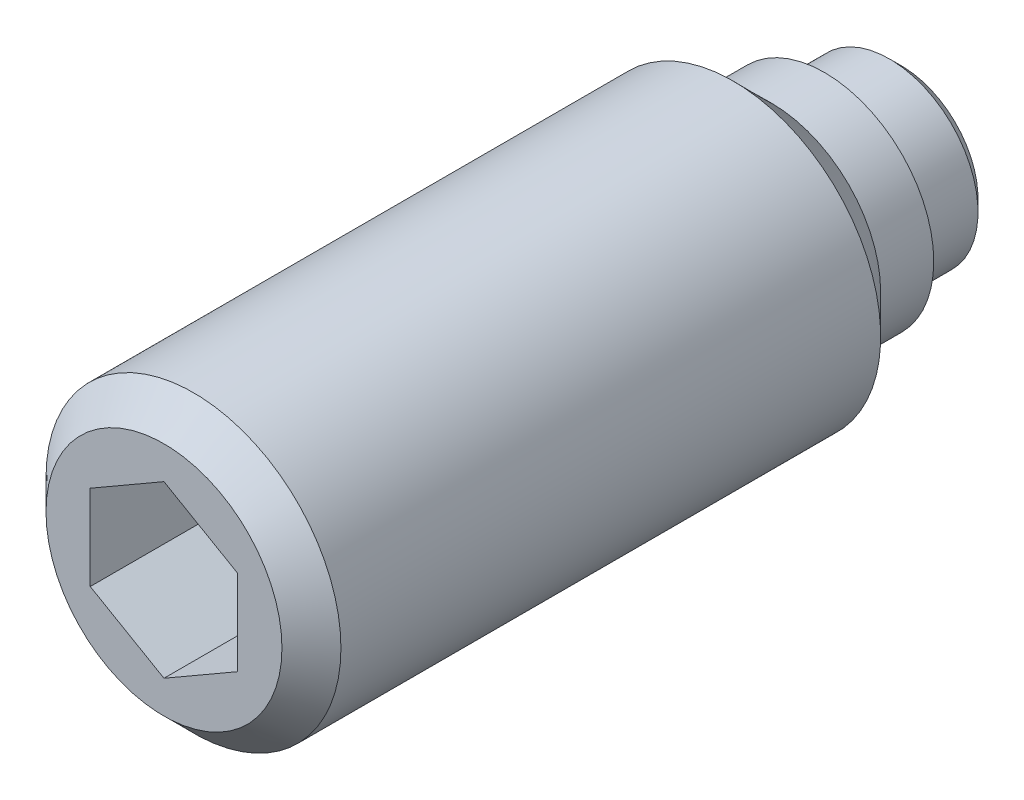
ISO-10303-21;
HEADER;
FILE_DESCRIPTION(('STEP AP214'),'2;1');
FILE_NAME('part.step','',(''),(''),'','','');
FILE_SCHEMA(('AUTOMOTIVE_DESIGN { 1 0 10303 214 1 1 1 1 }'));
ENDSEC;
DATA;
#1=APPLICATION_CONTEXT('core data for automotive mechanical design processes');
#2=APPLICATION_PROTOCOL_DEFINITION('international standard','automotive_design',2000,#1);
#3=PRODUCT_CONTEXT('',#1,'mechanical');
#4=PRODUCT('Part','Part','',(#3));
#5=PRODUCT_RELATED_PRODUCT_CATEGORY('part','',(#4));
#6=PRODUCT_DEFINITION_FORMATION('','',#4);
#7=PRODUCT_DEFINITION_CONTEXT('part definition',#1,'design');
#8=PRODUCT_DEFINITION('design','',#6,#7);
#9=PRODUCT_DEFINITION_SHAPE('','',#8);
#10=(LENGTH_UNIT() NAMED_UNIT(*) SI_UNIT(.MILLI.,.METRE.));
#11=(NAMED_UNIT(*) PLANE_ANGLE_UNIT() SI_UNIT($,.RADIAN.));
#12=(NAMED_UNIT(*) SI_UNIT($,.STERADIAN.) SOLID_ANGLE_UNIT());
#13=UNCERTAINTY_MEASURE_WITH_UNIT(LENGTH_MEASURE(1.E-05),#10,'distance_accuracy_value','');
#14=(GEOMETRIC_REPRESENTATION_CONTEXT(3) GLOBAL_UNCERTAINTY_ASSIGNED_CONTEXT((#13)) GLOBAL_UNIT_ASSIGNED_CONTEXT((#10,
#11,#12)) REPRESENTATION_CONTEXT('',''));
#15=CARTESIAN_POINT('',(0.,0.,0.));
#16=DIRECTION('',(0.,0.,1.));
#17=DIRECTION('',(1.,0.,0.));
#18=AXIS2_PLACEMENT_3D('',#15,#16,#17);
#19=CARTESIAN_POINT('',(0.,1.85,1.3));
#20=DIRECTION('',(0.,0.,1.));
#21=DIRECTION('',(1.,0.,0.));
#22=AXIS2_PLACEMENT_3D('',#19,#20,#21);
#23=PLANE('',#22);
#24=CARTESIAN_POINT('',(0.,0.,1.3));
#25=DIRECTION('',(0.,0.,-1.));
#26=DIRECTION('',(-1.,0.,0.));
#27=AXIS2_PLACEMENT_3D('',#24,#25,#26);
#28=CIRCLE('',#27,1.5);
#29=CARTESIAN_POINT('',(-1.5,0.,1.3));
#30=VERTEX_POINT('',#29);
#31=EDGE_CURVE('E130',#30,#30,#28,.T.);
#32=ORIENTED_EDGE('',*,*,#31,.F.);
#33=EDGE_LOOP('',(#32));
#34=FACE_BOUND('',#33,.T.);
#35=CARTESIAN_POINT('',(0.,0.,1.3));
#36=DIRECTION('',(0.,0.,-1.));
#37=DIRECTION('',(-1.,0.,0.));
#38=AXIS2_PLACEMENT_3D('',#35,#36,#37);
#39=CIRCLE('',#38,1.85);
#40=CARTESIAN_POINT('',(-1.85,0.,1.3));
#41=VERTEX_POINT('',#40);
#42=EDGE_CURVE('E133',#41,#41,#39,.T.);
#43=ORIENTED_EDGE('',*,*,#42,.T.);
#44=EDGE_LOOP('',(#43));
#45=FACE_BOUND('',#44,.T.);
#46=ADVANCED_FACE('F14',(#34,#45),#23,.F.);
#47=CARTESIAN_POINT('',(0.,0.,1.3));
#48=DIRECTION('',(0.,0.,-1.));
#49=DIRECTION('',(-1.,0.,0.));
#50=AXIS2_PLACEMENT_3D('',#47,#48,#49);
#51=CYLINDRICAL_SURFACE('',#50,2.5);
#52=CARTESIAN_POINT('',(0.,0.,12.));
#53=DIRECTION('',(0.,0.,1.));
#54=DIRECTION('',(1.,0.,0.));
#55=AXIS2_PLACEMENT_3D('',#52,#53,#54);
#56=CIRCLE('',#55,2.5);
#57=CARTESIAN_POINT('',(2.5,0.,12.));
#58=VERTEX_POINT('',#57);
#59=EDGE_CURVE('E9',#58,#58,#56,.F.);
#60=ORIENTED_EDGE('',*,*,#59,.T.);
#61=EDGE_LOOP('',(#60));
#62=FACE_BOUND('',#61,.T.);
#63=CARTESIAN_POINT('',(0.,0.,2.85));
#64=DIRECTION('',(0.,0.,-1.));
#65=DIRECTION('',(-1.,0.,0.));
#66=AXIS2_PLACEMENT_3D('',#63,#64,#65);
#67=CIRCLE('',#66,2.5);
#68=CARTESIAN_POINT('',(-2.5,0.,2.85));
#69=VERTEX_POINT('',#68);
#70=EDGE_CURVE('E139',#69,#69,#67,.T.);
#71=ORIENTED_EDGE('',*,*,#70,.F.);
#72=EDGE_LOOP('',(#71));
#73=FACE_BOUND('',#72,.T.);
#74=ADVANCED_FACE('F157',(#62,#73),#51,.T.);
#75=CARTESIAN_POINT('',(0.,0.,2.85));
#76=DIRECTION('',(0.,0.,1.));
#77=DIRECTION('',(1.,0.,0.));
#78=AXIS2_PLACEMENT_3D('',#75,#76,#77);
#79=CONICAL_SURFACE('',#78,2.5,0.785398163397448);
#80=CARTESIAN_POINT('',(0.,0.,2.2));
#81=DIRECTION('',(0.,0.,-1.));
#82=DIRECTION('',(-1.,0.,0.));
#83=AXIS2_PLACEMENT_3D('',#80,#81,#82);
#84=CIRCLE('',#83,1.85);
#85=CARTESIAN_POINT('',(-1.85,0.,2.2));
#86=VERTEX_POINT('',#85);
#87=EDGE_CURVE('E136',#86,#86,#84,.T.);
#88=ORIENTED_EDGE('',*,*,#87,.F.);
#89=EDGE_LOOP('',(#88));
#90=FACE_BOUND('',#89,.T.);
#91=ORIENTED_EDGE('',*,*,#70,.T.);
#92=EDGE_LOOP('',(#91));
#93=FACE_BOUND('',#92,.T.);
#94=ADVANCED_FACE('F164',(#90,#93),#79,.T.);
#95=CARTESIAN_POINT('',(0.,0.,1.3));
#96=DIRECTION('',(0.,0.,-1.));
#97=DIRECTION('',(-1.,0.,0.));
#98=AXIS2_PLACEMENT_3D('',#95,#96,#97);
#99=CYLINDRICAL_SURFACE('',#98,1.85);
#100=ORIENTED_EDGE('',*,*,#42,.F.);
#101=EDGE_LOOP('',(#100));
#102=FACE_BOUND('',#101,.T.);
#103=ORIENTED_EDGE('',*,*,#87,.T.);
#104=EDGE_LOOP('',(#103));
#105=FACE_BOUND('',#104,.T.);
#106=ADVANCED_FACE('F172',(#102,#105),#99,.T.);
#107=CARTESIAN_POINT('',(0.,0.,-0.5));
#108=DIRECTION('',(0.,0.,-1.));
#109=DIRECTION('',(-1.,0.,0.));
#110=AXIS2_PLACEMENT_3D('',#107,#108,#109);
#111=CYLINDRICAL_SURFACE('',#110,1.5);
#112=CARTESIAN_POINT('',(0.,0.,0.2));
#113=DIRECTION('',(0.,0.,-1.));
#114=DIRECTION('',(-1.,0.,0.));
#115=AXIS2_PLACEMENT_3D('',#112,#113,#114);
#116=CIRCLE('',#115,1.5);
#117=CARTESIAN_POINT('',(-1.5,0.,0.2));
#118=VERTEX_POINT('',#117);
#119=EDGE_CURVE('E127',#118,#118,#116,.T.);
#120=ORIENTED_EDGE('',*,*,#119,.F.);
#121=EDGE_LOOP('',(#120));
#122=FACE_BOUND('',#121,.T.);
#123=ORIENTED_EDGE('',*,*,#31,.T.);
#124=EDGE_LOOP('',(#123));
#125=FACE_BOUND('',#124,.T.);
#126=ADVANCED_FACE('F170',(#122,#125),#111,.T.);
#127=CARTESIAN_POINT('',(0.,0.,0.2));
#128=DIRECTION('',(0.,0.,1.));
#129=DIRECTION('',(1.,0.,0.));
#130=AXIS2_PLACEMENT_3D('',#127,#128,#129);
#131=CONICAL_SURFACE('',#130,1.5,0.785398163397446);
#132=CARTESIAN_POINT('',(0.,0.,0.));
#133=DIRECTION('',(0.,0.,-1.));
#134=DIRECTION('',(-1.,0.,0.));
#135=AXIS2_PLACEMENT_3D('',#132,#133,#134);
#136=CIRCLE('',#135,1.3);
#137=CARTESIAN_POINT('',(-1.3,0.,0.));
#138=VERTEX_POINT('',#137);
#139=EDGE_CURVE('E124',#138,#138,#136,.T.);
#140=ORIENTED_EDGE('',*,*,#139,.F.);
#141=EDGE_LOOP('',(#140));
#142=FACE_BOUND('',#141,.T.);
#143=ORIENTED_EDGE('',*,*,#119,.T.);
#144=EDGE_LOOP('',(#143));
#145=FACE_BOUND('',#144,.T.);
#146=ADVANCED_FACE('F204',(#142,#145),#131,.T.);
#147=CARTESIAN_POINT('',(0.,1.3,0.));
#148=DIRECTION('',(0.,0.,1.));
#149=DIRECTION('',(1.,0.,0.));
#150=AXIS2_PLACEMENT_3D('',#147,#148,#149);
#151=PLANE('',#150);
#152=CARTESIAN_POINT('',(0.,0.,0.));
#153=DIRECTION('',(0.,0.,-1.));
#154=DIRECTION('',(-1.,0.,0.));
#155=AXIS2_PLACEMENT_3D('',#152,#153,#154);
#156=CIRCLE('',#155,0.5);
#157=CARTESIAN_POINT('',(-0.5,0.,0.));
#158=VERTEX_POINT('',#157);
#159=EDGE_CURVE('E114',#158,#158,#156,.T.);
#160=ORIENTED_EDGE('',*,*,#159,.F.);
#161=EDGE_LOOP('',(#160));
#162=FACE_BOUND('',#161,.T.);
#163=ORIENTED_EDGE('',*,*,#139,.T.);
#164=EDGE_LOOP('',(#163));
#165=FACE_BOUND('',#164,.T.);
#166=ADVANCED_FACE('F212',(#162,#165),#151,.F.);
#167=CARTESIAN_POINT('',(0.,0.,0.));
#168=DIRECTION('',(0.,0.,1.));
#169=DIRECTION('',(1.,0.,0.));
#170=AXIS2_PLACEMENT_3D('',#167,#168,#169);
#171=CONICAL_SURFACE('',#170,0.5,0.785398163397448);
#172=CARTESIAN_POINT('',(0.,0.,-0.5));
#173=VERTEX_POINT('',#172);
#174=VERTEX_LOOP('',#173);
#175=FACE_BOUND('',#174,.T.);
#176=ORIENTED_EDGE('',*,*,#159,.T.);
#177=EDGE_LOOP('',(#176));
#178=FACE_BOUND('',#177,.T.);
#179=ADVANCED_FACE('F220',(#175,#178),#171,.T.);
#180=CARTESIAN_POINT('',(0.,0.,12.5));
#181=DIRECTION('',(0.,0.,1.));
#182=DIRECTION('',(1.,0.,0.));
#183=AXIS2_PLACEMENT_3D('',#180,#181,#182);
#184=PLANE('',#183);
#185=CARTESIAN_POINT('',(0.,0.,12.5));
#186=DIRECTION('',(0.,0.,1.));
#187=DIRECTION('',(1.,0.,0.));
#188=AXIS2_PLACEMENT_3D('',#185,#186,#187);
#189=CIRCLE('',#188,2.);
#190=CARTESIAN_POINT('',(2.,0.,12.5));
#191=VERTEX_POINT('',#190);
#192=EDGE_CURVE('E22',#191,#191,#189,.T.);
#193=ORIENTED_EDGE('',*,*,#192,.T.);
#194=EDGE_LOOP('',(#193));
#195=FACE_BOUND('',#194,.T.);
#196=DIRECTION('',(-0.866025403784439,0.5,0.));
#197=VECTOR('',#196,1.);
#198=CARTESIAN_POINT('',(1.25,0.721687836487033,12.5));
#199=LINE('',#198,#197);
#200=CARTESIAN_POINT('',(1.25,0.721687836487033,12.5));
#201=VERTEX_POINT('',#200);
#202=CARTESIAN_POINT('',(0.,1.44337567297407,12.5));
#203=VERTEX_POINT('',#202);
#204=EDGE_CURVE('E29',#201,#203,#199,.T.);
#205=ORIENTED_EDGE('',*,*,#204,.F.);
#206=DIRECTION('',(0.,1.,0.));
#207=VECTOR('',#206,1.);
#208=CARTESIAN_POINT('',(1.25,-0.721687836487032,12.5));
#209=LINE('',#208,#207);
#210=CARTESIAN_POINT('',(1.25,-0.721687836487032,12.5));
#211=VERTEX_POINT('',#210);
#212=EDGE_CURVE('E88',#211,#201,#209,.T.);
#213=ORIENTED_EDGE('',*,*,#212,.F.);
#214=DIRECTION('',(0.866025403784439,0.5,0.));
#215=VECTOR('',#214,1.);
#216=CARTESIAN_POINT('',(0.,-1.44337567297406,12.5));
#217=LINE('',#216,#215);
#218=CARTESIAN_POINT('',(0.,-1.44337567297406,12.5));
#219=VERTEX_POINT('',#218);
#220=EDGE_CURVE('E91',#219,#211,#217,.T.);
#221=ORIENTED_EDGE('',*,*,#220,.F.);
#222=DIRECTION('',(0.866025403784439,-0.5,0.));
#223=VECTOR('',#222,1.);
#224=CARTESIAN_POINT('',(-1.25,-0.721687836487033,12.5));
#225=LINE('',#224,#223);
#226=CARTESIAN_POINT('',(-1.25,-0.721687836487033,12.5));
#227=VERTEX_POINT('',#226);
#228=EDGE_CURVE('E107',#227,#219,#225,.T.);
#229=ORIENTED_EDGE('',*,*,#228,.F.);
#230=DIRECTION('',(0.,-1.,0.));
#231=VECTOR('',#230,1.);
#232=CARTESIAN_POINT('',(-1.25,0.721687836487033,12.5));
#233=LINE('',#232,#231);
#234=CARTESIAN_POINT('',(-1.25,0.721687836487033,12.5));
#235=VERTEX_POINT('',#234);
#236=EDGE_CURVE('E104',#235,#227,#233,.T.);
#237=ORIENTED_EDGE('',*,*,#236,.F.);
#238=DIRECTION('',(-0.866025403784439,-0.5,0.));
#239=VECTOR('',#238,1.);
#240=CARTESIAN_POINT('',(0.,1.44337567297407,12.5));
#241=LINE('',#240,#239);
#242=EDGE_CURVE('E102',#203,#235,#241,.T.);
#243=ORIENTED_EDGE('',*,*,#242,.F.);
#244=EDGE_LOOP('',(#205,#213,#221,#229,#237,#243));
#245=FACE_BOUND('',#244,.T.);
#246=ADVANCED_FACE('F144',(#195,#245),#184,.T.);
#247=CARTESIAN_POINT('',(1.25,0.721687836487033,9.5));
#248=DIRECTION('',(0.5,0.866025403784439,0.));
#249=DIRECTION('',(-0.866025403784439,0.5,0.));
#250=AXIS2_PLACEMENT_3D('',#247,#248,#249);
#251=PLANE('',#250);
#252=ORIENTED_EDGE('',*,*,#204,.T.);
#253=DIRECTION('',(0.,0.,1.));
#254=VECTOR('',#253,1.);
#255=CARTESIAN_POINT('',(0.,1.44337567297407,9.5));
#256=LINE('',#255,#254);
#257=CARTESIAN_POINT('',(0.,1.44337567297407,9.5));
#258=VERTEX_POINT('',#257);
#259=EDGE_CURVE('E65',#258,#203,#256,.T.);
#260=ORIENTED_EDGE('',*,*,#259,.F.);
#261=DIRECTION('',(-0.866025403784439,0.5,0.));
#262=VECTOR('',#261,1.);
#263=CARTESIAN_POINT('',(1.25,0.721687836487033,9.5));
#264=LINE('',#263,#262);
#265=CARTESIAN_POINT('',(1.25,0.721687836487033,9.5));
#266=VERTEX_POINT('',#265);
#267=EDGE_CURVE('E69',#266,#258,#264,.T.);
#268=ORIENTED_EDGE('',*,*,#267,.F.);
#269=DIRECTION('',(0.,0.,1.));
#270=VECTOR('',#269,1.);
#271=CARTESIAN_POINT('',(1.25,0.721687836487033,9.5));
#272=LINE('',#271,#270);
#273=EDGE_CURVE('E112',#266,#201,#272,.T.);
#274=ORIENTED_EDGE('',*,*,#273,.T.);
#275=EDGE_LOOP('',(#252,#260,#268,#274));
#276=FACE_BOUND('',#275,.T.);
#277=ADVANCED_FACE('F67',(#276),#251,.F.);
#278=CARTESIAN_POINT('',(1.25,-0.721687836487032,9.5));
#279=DIRECTION('',(1.,0.,0.));
#280=DIRECTION('',(0.,0.,-1.));
#281=AXIS2_PLACEMENT_3D('',#278,#279,#280);
#282=PLANE('',#281);
#283=ORIENTED_EDGE('',*,*,#212,.T.);
#284=ORIENTED_EDGE('',*,*,#273,.F.);
#285=DIRECTION('',(0.,1.,0.));
#286=VECTOR('',#285,1.);
#287=CARTESIAN_POINT('',(1.25,-0.721687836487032,9.5));
#288=LINE('',#287,#286);
#289=CARTESIAN_POINT('',(1.25,-0.721687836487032,9.5));
#290=VERTEX_POINT('',#289);
#291=EDGE_CURVE('E75',#290,#266,#288,.T.);
#292=ORIENTED_EDGE('',*,*,#291,.F.);
#293=DIRECTION('',(0.,0.,1.));
#294=VECTOR('',#293,1.);
#295=CARTESIAN_POINT('',(1.25,-0.721687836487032,9.5));
#296=LINE('',#295,#294);
#297=EDGE_CURVE('E115',#290,#211,#296,.T.);
#298=ORIENTED_EDGE('',*,*,#297,.T.);
#299=EDGE_LOOP('',(#283,#284,#292,#298));
#300=FACE_BOUND('',#299,.T.);
#301=ADVANCED_FACE('F243',(#300),#282,.F.);
#302=CARTESIAN_POINT('',(0.,-1.44337567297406,9.5));
#303=DIRECTION('',(0.5,-0.866025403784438,0.));
#304=DIRECTION('',(0.866025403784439,0.5,0.));
#305=AXIS2_PLACEMENT_3D('',#302,#303,#304);
#306=PLANE('',#305);
#307=ORIENTED_EDGE('',*,*,#220,.T.);
#308=ORIENTED_EDGE('',*,*,#297,.F.);
#309=DIRECTION('',(0.866025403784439,0.5,0.));
#310=VECTOR('',#309,1.);
#311=CARTESIAN_POINT('',(0.,-1.44337567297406,9.5));
#312=LINE('',#311,#310);
#313=CARTESIAN_POINT('',(0.,-1.44337567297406,9.5));
#314=VERTEX_POINT('',#313);
#315=EDGE_CURVE('E98',#314,#290,#312,.T.);
#316=ORIENTED_EDGE('',*,*,#315,.F.);
#317=DIRECTION('',(0.,0.,1.));
#318=VECTOR('',#317,1.);
#319=CARTESIAN_POINT('',(0.,-1.44337567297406,9.5));
#320=LINE('',#319,#318);
#321=EDGE_CURVE('E117',#314,#219,#320,.T.);
#322=ORIENTED_EDGE('',*,*,#321,.T.);
#323=EDGE_LOOP('',(#307,#308,#316,#322));
#324=FACE_BOUND('',#323,.T.);
#325=ADVANCED_FACE('F251',(#324),#306,.F.);
#326=CARTESIAN_POINT('',(-1.25,-0.721687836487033,9.5));
#327=DIRECTION('',(-0.5,-0.866025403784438,0.));
#328=DIRECTION('',(0.866025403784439,-0.5,0.));
#329=AXIS2_PLACEMENT_3D('',#326,#327,#328);
#330=PLANE('',#329);
#331=ORIENTED_EDGE('',*,*,#228,.T.);
#332=ORIENTED_EDGE('',*,*,#321,.F.);
#333=DIRECTION('',(0.866025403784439,-0.5,0.));
#334=VECTOR('',#333,1.);
#335=CARTESIAN_POINT('',(-1.25,-0.721687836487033,9.5));
#336=LINE('',#335,#334);
#337=CARTESIAN_POINT('',(-1.25,-0.721687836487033,9.5));
#338=VERTEX_POINT('',#337);
#339=EDGE_CURVE('E95',#338,#314,#336,.T.);
#340=ORIENTED_EDGE('',*,*,#339,.F.);
#341=DIRECTION('',(0.,0.,1.));
#342=VECTOR('',#341,1.);
#343=CARTESIAN_POINT('',(-1.25,-0.721687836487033,9.5));
#344=LINE('',#343,#342);
#345=EDGE_CURVE('E119',#338,#227,#344,.T.);
#346=ORIENTED_EDGE('',*,*,#345,.T.);
#347=EDGE_LOOP('',(#331,#332,#340,#346));
#348=FACE_BOUND('',#347,.T.);
#349=ADVANCED_FACE('F260',(#348),#330,.F.);
#350=CARTESIAN_POINT('',(-1.25,0.721687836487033,9.5));
#351=DIRECTION('',(-1.,0.,0.));
#352=DIRECTION('',(0.,-1.,0.));
#353=AXIS2_PLACEMENT_3D('',#350,#351,#352);
#354=PLANE('',#353);
#355=ORIENTED_EDGE('',*,*,#236,.T.);
#356=ORIENTED_EDGE('',*,*,#345,.F.);
#357=DIRECTION('',(0.,-1.,0.));
#358=VECTOR('',#357,1.);
#359=CARTESIAN_POINT('',(-1.25,0.721687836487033,9.5));
#360=LINE('',#359,#358);
#361=CARTESIAN_POINT('',(-1.25,0.721687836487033,9.5));
#362=VERTEX_POINT('',#361);
#363=EDGE_CURVE('E83',#362,#338,#360,.T.);
#364=ORIENTED_EDGE('',*,*,#363,.F.);
#365=DIRECTION('',(0.,0.,1.));
#366=VECTOR('',#365,1.);
#367=CARTESIAN_POINT('',(-1.25,0.721687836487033,9.5));
#368=LINE('',#367,#366);
#369=EDGE_CURVE('E74',#362,#235,#368,.T.);
#370=ORIENTED_EDGE('',*,*,#369,.T.);
#371=EDGE_LOOP('',(#355,#356,#364,#370));
#372=FACE_BOUND('',#371,.T.);
#373=ADVANCED_FACE('F269',(#372),#354,.F.);
#374=CARTESIAN_POINT('',(0.,1.44337567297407,9.5));
#375=DIRECTION('',(-0.5,0.866025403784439,0.));
#376=DIRECTION('',(-0.866025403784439,-0.5,0.));
#377=AXIS2_PLACEMENT_3D('',#374,#375,#376);
#378=PLANE('',#377);
#379=ORIENTED_EDGE('',*,*,#242,.T.);
#380=ORIENTED_EDGE('',*,*,#369,.F.);
#381=DIRECTION('',(-0.866025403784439,-0.5,0.));
#382=VECTOR('',#381,1.);
#383=CARTESIAN_POINT('',(0.,1.44337567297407,9.5));
#384=LINE('',#383,#382);
#385=EDGE_CURVE('E78',#258,#362,#384,.T.);
#386=ORIENTED_EDGE('',*,*,#385,.F.);
#387=ORIENTED_EDGE('',*,*,#259,.T.);
#388=EDGE_LOOP('',(#379,#380,#386,#387));
#389=FACE_BOUND('',#388,.T.);
#390=ADVANCED_FACE('F79',(#389),#378,.F.);
#391=CARTESIAN_POINT('',(0.,0.,9.5));
#392=DIRECTION('',(0.,0.,1.));
#393=DIRECTION('',(1.,0.,0.));
#394=AXIS2_PLACEMENT_3D('',#391,#392,#393);
#395=PLANE('',#394);
#396=ORIENTED_EDGE('',*,*,#267,.T.);
#397=ORIENTED_EDGE('',*,*,#385,.T.);
#398=ORIENTED_EDGE('',*,*,#363,.T.);
#399=ORIENTED_EDGE('',*,*,#339,.T.);
#400=ORIENTED_EDGE('',*,*,#315,.T.);
#401=ORIENTED_EDGE('',*,*,#291,.T.);
#402=EDGE_LOOP('',(#396,#397,#398,#399,#400,#401));
#403=FACE_BOUND('',#402,.T.);
#404=ADVANCED_FACE('F85',(#403),#395,.T.);
#405=CARTESIAN_POINT('',(0.,0.,12.5));
#406=DIRECTION('',(0.,0.,-1.));
#407=DIRECTION('',(-1.,0.,0.));
#408=AXIS2_PLACEMENT_3D('',#405,#406,#407);
#409=CONICAL_SURFACE('',#408,2.,0.785398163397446);
#410=ORIENTED_EDGE('',*,*,#59,.F.);
#411=EDGE_LOOP('',(#410));
#412=FACE_BOUND('',#411,.T.);
#413=ORIENTED_EDGE('',*,*,#192,.F.);
#414=EDGE_LOOP('',(#413));
#415=FACE_BOUND('',#414,.T.);
#416=ADVANCED_FACE('F16',(#412,#415),#409,.T.);
#417=CLOSED_SHELL('',(#46,#74,#94,#106,#126,#146,#166,#179,#246,#277,#301,#325,#349,#373,#390,
#404,#416));
#418=MANIFOLD_SOLID_BREP('B1',#417);
#419=ADVANCED_BREP_SHAPE_REPRESENTATION('',(#18,#418),#14);
#420=SHAPE_DEFINITION_REPRESENTATION(#9,#419);
ENDSEC;
END-ISO-10303-21;
